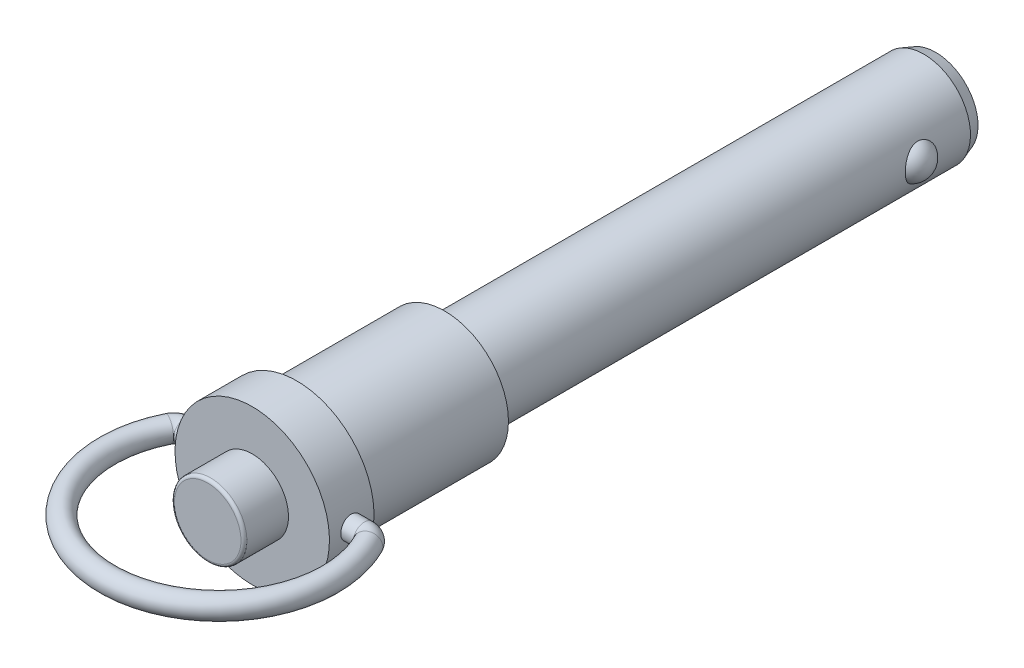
ISO-10303-21;
HEADER;
FILE_DESCRIPTION(('STEP AP214'),'2;1');
FILE_NAME('part.step','',(''),(''),'','','');
FILE_SCHEMA(('AUTOMOTIVE_DESIGN { 1 0 10303 214 1 1 1 1 }'));
ENDSEC;
DATA;
#1=APPLICATION_CONTEXT('core data for automotive mechanical design processes');
#2=APPLICATION_PROTOCOL_DEFINITION('international standard','automotive_design',2000,#1);
#3=PRODUCT_CONTEXT('',#1,'mechanical');
#4=PRODUCT('Part','Part','',(#3));
#5=PRODUCT_RELATED_PRODUCT_CATEGORY('part','',(#4));
#6=PRODUCT_DEFINITION_FORMATION('','',#4);
#7=PRODUCT_DEFINITION_CONTEXT('part definition',#1,'design');
#8=PRODUCT_DEFINITION('design','',#6,#7);
#9=PRODUCT_DEFINITION_SHAPE('','',#8);
#10=(LENGTH_UNIT() NAMED_UNIT(*) SI_UNIT(.MILLI.,.METRE.));
#11=(NAMED_UNIT(*) PLANE_ANGLE_UNIT() SI_UNIT($,.RADIAN.));
#12=(NAMED_UNIT(*) SI_UNIT($,.STERADIAN.) SOLID_ANGLE_UNIT());
#13=UNCERTAINTY_MEASURE_WITH_UNIT(LENGTH_MEASURE(1.E-05),#10,'distance_accuracy_value','');
#14=(GEOMETRIC_REPRESENTATION_CONTEXT(3) GLOBAL_UNCERTAINTY_ASSIGNED_CONTEXT((#13)) GLOBAL_UNIT_ASSIGNED_CONTEXT((#10,
#11,#12)) REPRESENTATION_CONTEXT('',''));
#15=CARTESIAN_POINT('',(0.,0.,0.));
#16=DIRECTION('',(0.,0.,1.));
#17=DIRECTION('',(1.,0.,0.));
#18=AXIS2_PLACEMENT_3D('',#15,#16,#17);
#19=CARTESIAN_POINT('',(0.,0.,40.545));
#20=DIRECTION('',(0.,0.,1.));
#21=DIRECTION('',(0.,1.,0.));
#22=AXIS2_PLACEMENT_3D('',#19,#20,#21);
#23=PLANE('',#22);
#24=CARTESIAN_POINT('',(0.,0.,40.545));
#25=DIRECTION('',(0.,0.,-1.));
#26=DIRECTION('',(0.,-1.,0.));
#27=AXIS2_PLACEMENT_3D('',#24,#25,#26);
#28=CIRCLE('',#27,5.6896);
#29=CARTESIAN_POINT('',(0.,-5.6896,40.545));
#30=VERTEX_POINT('',#29);
#31=CARTESIAN_POINT('',(0.,5.6896,40.545));
#32=VERTEX_POINT('',#31);
#33=EDGE_CURVE('E38',#30,#32,#28,.T.);
#34=ORIENTED_EDGE('',*,*,#33,.F.);
#35=CARTESIAN_POINT('',(0.,0.,40.545));
#36=DIRECTION('',(0.,0.,-1.));
#37=DIRECTION('',(0.,1.,0.));
#38=AXIS2_PLACEMENT_3D('',#35,#36,#37);
#39=CIRCLE('',#38,5.6896);
#40=EDGE_CURVE('E31',#32,#30,#39,.T.);
#41=ORIENTED_EDGE('',*,*,#40,.F.);
#42=EDGE_LOOP('',(#34,#41));
#43=FACE_BOUND('',#42,.T.);
#44=ADVANCED_FACE('F14',(#43),#23,.T.);
#45=CARTESIAN_POINT('',(0.,0.,40.037));
#46=DIRECTION('',(0.,0.,1.));
#47=DIRECTION('',(0.,1.,0.));
#48=AXIS2_PLACEMENT_3D('',#45,#46,#47);
#49=TOROIDAL_SURFACE('',#48,5.6896,0.508);
#50=ORIENTED_EDGE('',*,*,#40,.T.);
#51=ORIENTED_EDGE('',*,*,#33,.T.);
#52=EDGE_LOOP('',(#50,#51));
#53=FACE_BOUND('',#52,.T.);
#54=CARTESIAN_POINT('',(0.,0.,40.037));
#55=DIRECTION('',(0.,0.,-1.));
#56=DIRECTION('',(0.,-1.,0.));
#57=AXIS2_PLACEMENT_3D('',#54,#55,#56);
#58=CIRCLE('',#57,6.1976);
#59=CARTESIAN_POINT('',(0.,-6.1976,40.037));
#60=VERTEX_POINT('',#59);
#61=EDGE_CURVE('E80',#60,#60,#58,.T.);
#62=ORIENTED_EDGE('',*,*,#61,.F.);
#63=EDGE_LOOP('',(#62));
#64=FACE_BOUND('',#63,.T.);
#65=ADVANCED_FACE('F36',(#53,#64),#49,.T.);
#66=CARTESIAN_POINT('',(0.,0.,40.545));
#67=DIRECTION('',(0.,0.,-1.));
#68=DIRECTION('',(0.,-1.,0.));
#69=AXIS2_PLACEMENT_3D('',#66,#67,#68);
#70=CYLINDRICAL_SURFACE('',#69,6.1976);
#71=CARTESIAN_POINT('',(0.,0.,32.925));
#72=DIRECTION('',(0.,0.,-1.));
#73=DIRECTION('',(0.,-1.,0.));
#74=AXIS2_PLACEMENT_3D('',#71,#72,#73);
#75=CIRCLE('',#74,6.1976);
#76=CARTESIAN_POINT('',(0.,-6.1976,32.925));
#77=VERTEX_POINT('',#76);
#78=EDGE_CURVE('E231',#77,#77,#75,.T.);
#79=ORIENTED_EDGE('',*,*,#78,.F.);
#80=EDGE_LOOP('',(#79));
#81=FACE_BOUND('',#80,.T.);
#82=ORIENTED_EDGE('',*,*,#61,.T.);
#83=EDGE_LOOP('',(#82));
#84=FACE_BOUND('',#83,.T.);
#85=ADVANCED_FACE('F86',(#81,#84),#70,.T.);
#86=CARTESIAN_POINT('',(-13.208,0.,32.925));
#87=DIRECTION('',(0.,0.,1.));
#88=DIRECTION('',(0.,1.,0.));
#89=AXIS2_PLACEMENT_3D('',#86,#87,#88);
#90=PLANE('',#89);
#91=ORIENTED_EDGE('',*,*,#78,.T.);
#92=EDGE_LOOP('',(#91));
#93=FACE_BOUND('',#92,.T.);
#94=CARTESIAN_POINT('',(0.,0.,32.925));
#95=DIRECTION('',(0.,0.,-1.));
#96=DIRECTION('',(0.,-1.,0.));
#97=AXIS2_PLACEMENT_3D('',#94,#95,#96);
#98=CIRCLE('',#97,13.208);
#99=CARTESIAN_POINT('',(0.,-13.208,32.925));
#100=VERTEX_POINT('',#99);
#101=EDGE_CURVE('E234',#100,#100,#98,.T.);
#102=ORIENTED_EDGE('',*,*,#101,.F.);
#103=EDGE_LOOP('',(#102));
#104=FACE_BOUND('',#103,.T.);
#105=ADVANCED_FACE('F217',(#93,#104),#90,.T.);
#106=CARTESIAN_POINT('',(0.,0.,-2.));
#107=DIRECTION('',(0.,0.,-1.));
#108=DIRECTION('',(0.,-1.,0.));
#109=AXIS2_PLACEMENT_3D('',#106,#107,#108);
#110=CYLINDRICAL_SURFACE('',#109,13.208);
#111=CARTESIAN_POINT('',(0.,0.,25.305));
#112=DIRECTION('',(0.,0.,-1.));
#113=DIRECTION('',(0.,-1.,0.));
#114=AXIS2_PLACEMENT_3D('',#111,#112,#113);
#115=CIRCLE('',#114,13.208);
#116=CARTESIAN_POINT('',(0.,-13.208,25.305));
#117=VERTEX_POINT('',#116);
#118=EDGE_CURVE('E154',#117,#117,#115,.T.);
#119=ORIENTED_EDGE('',*,*,#118,.F.);
#120=EDGE_LOOP('',(#119));
#121=FACE_BOUND('',#120,.T.);
#122=ORIENTED_EDGE('',*,*,#101,.T.);
#123=EDGE_LOOP('',(#122));
#124=FACE_BOUND('',#123,.T.);
#125=CARTESIAN_POINT('',(13.208,0.,27.2354));
#126=CARTESIAN_POINT('',(13.2079983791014,-0.105008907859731,27.235404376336));
#127=CARTESIAN_POINT('',(13.2067345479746,-0.210080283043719,27.2442296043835));
#128=CARTESIAN_POINT('',(13.2018144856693,-0.417290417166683,27.2792908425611));
#129=CARTESIAN_POINT('',(13.1981558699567,-0.51942614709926,27.3055442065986));
#130=CARTESIAN_POINT('',(13.1888577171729,-0.717735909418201,27.3746649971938));
#131=CARTESIAN_POINT('',(13.1832196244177,-0.813914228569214,27.4175203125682));
#132=CARTESIAN_POINT('',(13.1705868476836,-0.997698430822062,27.5185998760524));
#133=CARTESIAN_POINT('',(13.1635923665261,-1.08530559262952,27.5768218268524));
#134=CARTESIAN_POINT('',(13.1489704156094,-1.25009506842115,27.7074204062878));
#135=CARTESIAN_POINT('',(13.1413392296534,-1.32720810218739,27.7798840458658));
#136=CARTESIAN_POINT('',(13.1263333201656,-1.46822296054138,27.9367218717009));
#137=CARTESIAN_POINT('',(13.1189586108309,-1.5321240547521,28.0210967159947));
#138=CARTESIAN_POINT('',(13.1052644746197,-1.6451672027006,28.1998226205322));
#139=CARTESIAN_POINT('',(13.0989498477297,-1.69424288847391,28.2942160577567));
#140=CARTESIAN_POINT('',(13.088141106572,-1.77581811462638,28.490010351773));
#141=CARTESIAN_POINT('',(13.0836469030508,-1.80831846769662,28.5914108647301));
#142=CARTESIAN_POINT('',(13.0770241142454,-1.85560673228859,28.7976151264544));
#143=CARTESIAN_POINT('',(13.0748797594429,-1.87051276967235,28.9023912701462));
#144=CARTESIAN_POINT('',(13.0731514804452,-1.88255508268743,29.1129780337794));
#145=CARTESIAN_POINT('',(13.0735674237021,-1.87969227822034,29.2187885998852));
#146=CARTESIAN_POINT('',(13.0768983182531,-1.85637484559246,29.4276098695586));
#147=CARTESIAN_POINT('',(13.07979464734,-1.8360513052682,29.5306355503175));
#148=CARTESIAN_POINT('',(13.0877308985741,-1.77859429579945,29.7317993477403));
#149=CARTESIAN_POINT('',(13.0927708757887,-1.74146039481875,29.8299373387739));
#150=CARTESIAN_POINT('',(13.1044472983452,-1.65129893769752,30.0189415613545));
#151=CARTESIAN_POINT('',(13.1110893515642,-1.59821538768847,30.1097807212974));
#152=CARTESIAN_POINT('',(13.1252173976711,-1.47770141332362,30.281311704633));
#153=CARTESIAN_POINT('',(13.1327034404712,-1.4102701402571,30.3620029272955));
#154=CARTESIAN_POINT('',(13.1477584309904,-1.26225301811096,30.5117076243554));
#155=CARTESIAN_POINT('',(13.1553275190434,-1.18155436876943,30.5806096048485));
#156=CARTESIAN_POINT('',(13.1696331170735,-1.00967896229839,30.7039085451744));
#157=CARTESIAN_POINT('',(13.1763696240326,-0.918502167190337,30.7583054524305));
#158=CARTESIAN_POINT('',(13.1882570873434,-0.728165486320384,30.8510539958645));
#159=CARTESIAN_POINT('',(13.1934072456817,-0.629001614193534,30.8893975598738));
#160=CARTESIAN_POINT('',(13.2015349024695,-0.425552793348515,30.9488568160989));
#161=CARTESIAN_POINT('',(13.2045125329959,-0.321268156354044,30.969973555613));
#162=CARTESIAN_POINT('',(13.2079422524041,-0.111500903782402,30.9942327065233));
#163=CARTESIAN_POINT('',(13.2084158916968,-0.0060363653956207,30.9975284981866));
#164=CARTESIAN_POINT('',(13.2068427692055,0.203940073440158,30.9864585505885));
#165=CARTESIAN_POINT('',(13.2047960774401,0.308452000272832,30.9720933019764));
#166=CARTESIAN_POINT('',(13.1984256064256,0.513095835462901,30.9262365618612));
#167=CARTESIAN_POINT('',(13.1941116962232,0.613244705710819,30.894819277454));
#168=CARTESIAN_POINT('',(13.1836891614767,0.806853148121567,30.8158281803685));
#169=CARTESIAN_POINT('',(13.1775804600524,0.900312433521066,30.7682536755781));
#170=CARTESIAN_POINT('',(13.1641942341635,1.07856665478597,30.6579350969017));
#171=CARTESIAN_POINT('',(13.1569092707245,1.16330041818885,30.5950930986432));
#172=CARTESIAN_POINT('',(13.1420059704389,1.32107337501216,30.4561604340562));
#173=CARTESIAN_POINT('',(13.1343876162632,1.39411195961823,30.3800690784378));
#174=CARTESIAN_POINT('',(13.1196084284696,1.52697484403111,30.2161171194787));
#175=CARTESIAN_POINT('',(13.1124514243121,1.58669669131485,30.1281730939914));
#176=CARTESIAN_POINT('',(13.099471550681,1.69052011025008,29.9434117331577));
#177=CARTESIAN_POINT('',(13.0936486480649,1.73462206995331,29.8465946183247));
#178=CARTESIAN_POINT('',(13.0840235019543,1.80579270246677,29.6471490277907));
#179=CARTESIAN_POINT('',(13.0802147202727,1.83291654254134,29.5445405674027));
#180=CARTESIAN_POINT('',(13.0750312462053,1.86953730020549,29.336166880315));
#181=CARTESIAN_POINT('',(13.0736564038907,1.87903530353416,29.2304018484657));
#182=CARTESIAN_POINT('',(13.0735016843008,1.88011086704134,29.0197377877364));
#183=CARTESIAN_POINT('',(13.0746984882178,1.87184946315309,28.9148395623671));
#184=CARTESIAN_POINT('',(13.0795017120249,1.83798448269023,28.7079399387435));
#185=CARTESIAN_POINT('',(13.0831081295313,1.81238092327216,28.6059385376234));
#186=CARTESIAN_POINT('',(13.092316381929,1.74461326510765,28.4077650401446));
#187=CARTESIAN_POINT('',(13.0979169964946,1.70245929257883,28.3115894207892));
#188=CARTESIAN_POINT('',(13.1104842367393,1.60280330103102,28.1276498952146));
#189=CARTESIAN_POINT('',(13.1174508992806,1.54530086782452,28.0398862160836));
#190=CARTESIAN_POINT('',(13.1320406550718,1.4159909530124,27.8744419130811));
#191=CARTESIAN_POINT('',(13.1396689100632,1.34406391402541,27.7968551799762));
#192=CARTESIAN_POINT('',(13.1546784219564,1.18819878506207,27.6547945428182));
#193=CARTESIAN_POINT('',(13.1620596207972,1.10425789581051,27.590323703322));
#194=CARTESIAN_POINT('',(13.1757845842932,0.926263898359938,27.4760444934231));
#195=CARTESIAN_POINT('',(13.1821230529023,0.832162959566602,27.4263100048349));
#196=CARTESIAN_POINT('',(13.1929960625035,0.636900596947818,27.3434245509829));
#197=CARTESIAN_POINT('',(13.1975325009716,0.535746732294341,27.3102561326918));
#198=CARTESIAN_POINT('',(13.2032356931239,0.361762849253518,27.2691055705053));
#199=CARTESIAN_POINT('',(13.205013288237,0.290014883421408,27.2564849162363));
#200=CARTESIAN_POINT('',(13.2073959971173,0.145521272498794,27.2396306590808));
#201=CARTESIAN_POINT('',(13.2080011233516,0.0727756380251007,27.2353969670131));
#202=CARTESIAN_POINT('',(13.208,0.,27.2354));
#203=B_SPLINE_CURVE_WITH_KNOTS('',3,(#125,#126,#127,#128,#129,#130,#131,#132,#133,#134,#135,
#136,#137,#138,#139,#140,#141,#142,#143,#144,#145,#146,#147,#148,#149,#150,#151,#152,#153,#154,
#155,#156,#157,#158,#159,#160,#161,#162,#163,#164,#165,#166,#167,#168,#169,#170,#171,#172,#173,
#174,#175,#176,#177,#178,#179,#180,#181,#182,#183,#184,#185,#186,#187,#188,#189,#190,#191,#192,
#193,#194,#195,#196,#197,#198,#199,#200,#201,#202),.UNSPECIFIED.,.T.,.F.,(4,2,2,2,2,2,2,2,2,2,2,
2,2,2,2,2,2,2,2,2,2,2,2,2,2,2,2,2,2,2,2,2,2,2,2,2,2,2,4),(0.,0.314760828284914,
0.629835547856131,0.944680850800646,1.25947911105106,1.57626405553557,1.89306650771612,
2.2112668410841,2.52945157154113,2.84548767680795,3.16150742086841,3.47517515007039,
3.7888509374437,4.1036410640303,4.41844981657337,4.73608844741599,5.05372822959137,
5.3715275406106,5.68930752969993,6.0043480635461,6.31937984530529,6.63305153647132,
6.94673666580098,7.2624894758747,7.57825871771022,7.89637938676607,8.21449215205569,
8.53156582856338,8.84861997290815,9.16281131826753,9.4770023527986,9.79100145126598,
10.1050090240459,10.42173562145,10.7385361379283,11.0568990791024,11.3749259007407,
11.5930708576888,11.8112134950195),.UNSPECIFIED.);
#204=CARTESIAN_POINT('',(13.208,0.,27.2354));
#205=VERTEX_POINT('',#204);
#206=EDGE_CURVE('E147',#205,#205,#203,.T.);
#207=ORIENTED_EDGE('',*,*,#206,.T.);
#208=EDGE_LOOP('',(#207));
#209=FACE_BOUND('',#208,.T.);
#210=CARTESIAN_POINT('',(-13.208,0.,27.2354));
#211=CARTESIAN_POINT('',(-13.2079983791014,0.105008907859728,27.235404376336));
#212=CARTESIAN_POINT('',(-13.2067345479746,0.210080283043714,27.2442296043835));
#213=CARTESIAN_POINT('',(-13.2018144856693,0.41729041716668,27.2792908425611));
#214=CARTESIAN_POINT('',(-13.1981558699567,0.519426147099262,27.3055442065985));
#215=CARTESIAN_POINT('',(-13.1888577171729,0.7177359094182,27.3746649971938));
#216=CARTESIAN_POINT('',(-13.1832196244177,0.813914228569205,27.4175203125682));
#217=CARTESIAN_POINT('',(-13.1705868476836,0.99769843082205,27.5185998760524));
#218=CARTESIAN_POINT('',(-13.1635923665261,1.08530559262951,27.5768218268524));
#219=CARTESIAN_POINT('',(-13.1489704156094,1.25009506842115,27.7074204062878));
#220=CARTESIAN_POINT('',(-13.1413392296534,1.32720810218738,27.7798840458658));
#221=CARTESIAN_POINT('',(-13.1263333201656,1.46822296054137,27.9367218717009));
#222=CARTESIAN_POINT('',(-13.1189586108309,1.5321240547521,28.0210967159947));
#223=CARTESIAN_POINT('',(-13.1052644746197,1.6451672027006,28.1998226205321));
#224=CARTESIAN_POINT('',(-13.0989498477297,1.69424288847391,28.2942160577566));
#225=CARTESIAN_POINT('',(-13.088141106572,1.77581811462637,28.490010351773));
#226=CARTESIAN_POINT('',(-13.0836469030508,1.80831846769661,28.5914108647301));
#227=CARTESIAN_POINT('',(-13.0770241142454,1.85560673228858,28.7976151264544));
#228=CARTESIAN_POINT('',(-13.0748797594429,1.87051276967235,28.9023912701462));
#229=CARTESIAN_POINT('',(-13.0731514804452,1.88255508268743,29.1129780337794));
#230=CARTESIAN_POINT('',(-13.0735674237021,1.87969227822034,29.2187885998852));
#231=CARTESIAN_POINT('',(-13.0768983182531,1.85637484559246,29.4276098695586));
#232=CARTESIAN_POINT('',(-13.07979464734,1.8360513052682,29.5306355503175));
#233=CARTESIAN_POINT('',(-13.0877308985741,1.77859429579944,29.7317993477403));
#234=CARTESIAN_POINT('',(-13.0927708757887,1.74146039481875,29.8299373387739));
#235=CARTESIAN_POINT('',(-13.1044472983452,1.65129893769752,30.0189415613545));
#236=CARTESIAN_POINT('',(-13.1110893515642,1.59821538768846,30.1097807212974));
#237=CARTESIAN_POINT('',(-13.1252173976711,1.47770141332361,30.281311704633));
#238=CARTESIAN_POINT('',(-13.1327034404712,1.4102701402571,30.3620029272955));
#239=CARTESIAN_POINT('',(-13.1477584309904,1.26225301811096,30.5117076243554));
#240=CARTESIAN_POINT('',(-13.1553275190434,1.18155436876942,30.5806096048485));
#241=CARTESIAN_POINT('',(-13.1696331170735,1.00967896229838,30.7039085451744));
#242=CARTESIAN_POINT('',(-13.1763696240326,0.918502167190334,30.7583054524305));
#243=CARTESIAN_POINT('',(-13.1882570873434,0.728165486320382,30.8510539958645));
#244=CARTESIAN_POINT('',(-13.1934072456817,0.62900161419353,30.8893975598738));
#245=CARTESIAN_POINT('',(-13.2015349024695,0.425552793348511,30.9488568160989));
#246=CARTESIAN_POINT('',(-13.2045125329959,0.321268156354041,30.969973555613));
#247=CARTESIAN_POINT('',(-13.2079422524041,0.111500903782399,30.9942327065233));
#248=CARTESIAN_POINT('',(-13.2084158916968,0.00603636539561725,30.9975284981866));
#249=CARTESIAN_POINT('',(-13.2068427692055,-0.203940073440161,30.9864585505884));
#250=CARTESIAN_POINT('',(-13.2047960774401,-0.308452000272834,30.9720933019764));
#251=CARTESIAN_POINT('',(-13.1984256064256,-0.513095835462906,30.9262365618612));
#252=CARTESIAN_POINT('',(-13.1941116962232,-0.613244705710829,30.894819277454));
#253=CARTESIAN_POINT('',(-13.1836891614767,-0.806853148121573,30.8158281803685));
#254=CARTESIAN_POINT('',(-13.1775804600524,-0.900312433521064,30.768253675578));
#255=CARTESIAN_POINT('',(-13.1641942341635,-1.07856665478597,30.6579350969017));
#256=CARTESIAN_POINT('',(-13.1569092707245,-1.16330041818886,30.5950930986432));
#257=CARTESIAN_POINT('',(-13.1420059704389,-1.32107337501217,30.4561604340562));
#258=CARTESIAN_POINT('',(-13.1343876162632,-1.39411195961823,30.3800690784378));
#259=CARTESIAN_POINT('',(-13.1196084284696,-1.52697484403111,30.2161171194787));
#260=CARTESIAN_POINT('',(-13.1124514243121,-1.58669669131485,30.1281730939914));
#261=CARTESIAN_POINT('',(-13.099471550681,-1.69052011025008,29.9434117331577));
#262=CARTESIAN_POINT('',(-13.0936486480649,-1.73462206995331,29.8465946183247));
#263=CARTESIAN_POINT('',(-13.0840235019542,-1.80579270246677,29.6471490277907));
#264=CARTESIAN_POINT('',(-13.0802147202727,-1.83291654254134,29.5445405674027));
#265=CARTESIAN_POINT('',(-13.0750312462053,-1.86953730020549,29.336166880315));
#266=CARTESIAN_POINT('',(-13.0736564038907,-1.87903530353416,29.2304018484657));
#267=CARTESIAN_POINT('',(-13.0735016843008,-1.88011086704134,29.0197377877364));
#268=CARTESIAN_POINT('',(-13.0746984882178,-1.87184946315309,28.9148395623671));
#269=CARTESIAN_POINT('',(-13.0795017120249,-1.83798448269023,28.7079399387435));
#270=CARTESIAN_POINT('',(-13.0831081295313,-1.81238092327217,28.6059385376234));
#271=CARTESIAN_POINT('',(-13.092316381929,-1.74461326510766,28.4077650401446));
#272=CARTESIAN_POINT('',(-13.0979169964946,-1.70245929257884,28.3115894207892));
#273=CARTESIAN_POINT('',(-13.1104842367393,-1.60280330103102,28.1276498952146));
#274=CARTESIAN_POINT('',(-13.1174508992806,-1.54530086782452,28.0398862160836));
#275=CARTESIAN_POINT('',(-13.1320406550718,-1.41599095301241,27.8744419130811));
#276=CARTESIAN_POINT('',(-13.1396689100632,-1.34406391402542,27.7968551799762));
#277=CARTESIAN_POINT('',(-13.1546784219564,-1.18819878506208,27.6547945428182));
#278=CARTESIAN_POINT('',(-13.1620596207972,-1.10425789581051,27.590323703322));
#279=CARTESIAN_POINT('',(-13.1757845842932,-0.926263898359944,27.4760444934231));
#280=CARTESIAN_POINT('',(-13.1821230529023,-0.832162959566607,27.4263100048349));
#281=CARTESIAN_POINT('',(-13.1929960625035,-0.636900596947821,27.3434245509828));
#282=CARTESIAN_POINT('',(-13.1975325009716,-0.535746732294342,27.3102561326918));
#283=CARTESIAN_POINT('',(-13.2032356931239,-0.361762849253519,27.2691055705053));
#284=CARTESIAN_POINT('',(-13.205013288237,-0.29001488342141,27.2564849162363));
#285=CARTESIAN_POINT('',(-13.2073959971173,-0.145521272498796,27.2396306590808));
#286=CARTESIAN_POINT('',(-13.2080011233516,-0.0727756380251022,27.2353969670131));
#287=CARTESIAN_POINT('',(-13.208,0.,27.2354));
#288=B_SPLINE_CURVE_WITH_KNOTS('',3,(#210,#211,#212,#213,#214,#215,#216,#217,#218,#219,#220,
#221,#222,#223,#224,#225,#226,#227,#228,#229,#230,#231,#232,#233,#234,#235,#236,#237,#238,#239,
#240,#241,#242,#243,#244,#245,#246,#247,#248,#249,#250,#251,#252,#253,#254,#255,#256,#257,#258,
#259,#260,#261,#262,#263,#264,#265,#266,#267,#268,#269,#270,#271,#272,#273,#274,#275,#276,#277,
#278,#279,#280,#281,#282,#283,#284,#285,#286,#287),.UNSPECIFIED.,.T.,.F.,(4,2,2,2,2,2,2,2,2,2,2,
2,2,2,2,2,2,2,2,2,2,2,2,2,2,2,2,2,2,2,2,2,2,2,2,2,2,2,4),(0.,0.314760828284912,
0.629835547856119,0.944680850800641,1.25947911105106,1.57626405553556,1.89306650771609,
2.21126684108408,2.52945157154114,2.84548767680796,3.16150742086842,3.4751751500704,
3.78885093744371,4.10364106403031,4.41844981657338,4.736088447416,5.05372822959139,
5.37152754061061,5.68930752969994,6.00434806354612,6.3193798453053,6.63305153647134,
6.94673666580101,7.26248947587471,7.57825871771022,7.89637938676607,8.21449215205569,
8.53156582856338,8.84861997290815,9.16281131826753,9.4770023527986,9.79100145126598,
10.1050090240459,10.42173562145,10.7385361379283,11.0568990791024,11.3749259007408,
11.5930708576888,11.8112134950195),.UNSPECIFIED.);
#289=CARTESIAN_POINT('',(-13.208,0.,27.2354));
#290=VERTEX_POINT('',#289);
#291=EDGE_CURVE('E24',#290,#290,#288,.T.);
#292=ORIENTED_EDGE('',*,*,#291,.T.);
#293=EDGE_LOOP('',(#292));
#294=FACE_BOUND('',#293,.T.);
#295=ADVANCED_FACE('F210',(#121,#124,#209,#294),#110,.T.);
#296=CARTESIAN_POINT('',(-12.319,0.,25.305));
#297=DIRECTION('',(0.,0.,-1.));
#298=DIRECTION('',(0.,-1.,0.));
#299=AXIS2_PLACEMENT_3D('',#296,#297,#298);
#300=PLANE('',#299);
#301=ORIENTED_EDGE('',*,*,#118,.T.);
#302=EDGE_LOOP('',(#301));
#303=FACE_BOUND('',#302,.T.);
#304=CARTESIAN_POINT('',(0.,0.,25.305));
#305=DIRECTION('',(0.,0.,1.));
#306=DIRECTION('',(1.,0.,0.));
#307=AXIS2_PLACEMENT_3D('',#304,#305,#306);
#308=CIRCLE('',#307,11.3);
#309=CARTESIAN_POINT('',(11.3,0.,25.305));
#310=VERTEX_POINT('',#309);
#311=EDGE_CURVE('E141',#310,#310,#308,.T.);
#312=ORIENTED_EDGE('',*,*,#311,.T.);
#313=EDGE_LOOP('',(#312));
#314=FACE_BOUND('',#313,.T.);
#315=ADVANCED_FACE('F208',(#303,#314),#300,.T.);
#316=CARTESIAN_POINT('',(-15.3586010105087,0.,31.02));
#317=DIRECTION('',(0.,1.,0.));
#318=DIRECTION('',(-1.,0.,0.));
#319=AXIS2_PLACEMENT_3D('',#316,#317,#318);
#320=TOROIDAL_SURFACE('',#319,1.905,1.8796);
#321=CARTESIAN_POINT('',(-15.3586010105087,0.,29.115));
#322=DIRECTION('',(1.,0.,0.));
#323=DIRECTION('',(0.,0.,-1.));
#324=AXIS2_PLACEMENT_3D('',#321,#322,#323);
#325=CIRCLE('',#324,1.8796);
#326=CARTESIAN_POINT('',(-15.3586010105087,0.,27.2354));
#327=VERTEX_POINT('',#326);
#328=EDGE_CURVE('E40',#327,#327,#325,.T.);
#329=ORIENTED_EDGE('',*,*,#328,.F.);
#330=EDGE_LOOP('',(#329));
#331=FACE_BOUND('',#330,.T.);
#332=CARTESIAN_POINT('',(-17.0651122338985,0.,30.1733333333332));
#333=DIRECTION('',(-0.44444444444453,0.,0.895806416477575));
#334=DIRECTION('',(-0.895806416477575,0.,-0.44444444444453));
#335=AXIS2_PLACEMENT_3D('',#332,#333,#334);
#336=CIRCLE('',#335,1.8796);
#337=CARTESIAN_POINT('',(-18.7488699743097,0.,29.3379555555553));
#338=VERTEX_POINT('',#337);
#339=EDGE_CURVE('E146',#338,#338,#336,.F.);
#340=ORIENTED_EDGE('',*,*,#339,.T.);
#341=EDGE_LOOP('',(#340));
#342=FACE_BOUND('',#341,.T.);
#343=ADVANCED_FACE('F63',(#331,#342),#320,.T.);
#344=CARTESIAN_POINT('',(-15.3586010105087,0.,29.115));
#345=DIRECTION('',(1.,0.,0.));
#346=DIRECTION('',(0.,0.,-1.));
#347=AXIS2_PLACEMENT_3D('',#344,#345,#346);
#348=CYLINDRICAL_SURFACE('',#347,1.8796);
#349=ORIENTED_EDGE('',*,*,#291,.F.);
#350=EDGE_LOOP('',(#349));
#351=FACE_BOUND('',#350,.T.);
#352=ORIENTED_EDGE('',*,*,#328,.T.);
#353=EDGE_LOOP('',(#352));
#354=FACE_BOUND('',#353,.T.);
#355=ADVANCED_FACE('F87',(#351,#354),#348,.T.);
#356=CARTESIAN_POINT('',(0.,0.,38.64));
#357=DIRECTION('',(0.,1.,0.));
#358=DIRECTION('',(-1.,0.,0.));
#359=AXIS2_PLACEMENT_3D('',#356,#357,#358);
#360=TOROIDAL_SURFACE('',#359,19.05,1.8796);
#361=ORIENTED_EDGE('',*,*,#339,.F.);
#362=EDGE_LOOP('',(#361));
#363=FACE_BOUND('',#362,.T.);
#364=CARTESIAN_POINT('',(17.0651122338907,0.,30.1733333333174));
#365=DIRECTION('',(-0.444444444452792,0.,-0.895806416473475));
#366=DIRECTION('',(0.895806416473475,0.,-0.444444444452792));
#367=AXIS2_PLACEMENT_3D('',#364,#365,#366);
#368=CIRCLE('',#367,1.8796);
#369=CARTESIAN_POINT('',(18.7488699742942,0.,29.3379555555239));
#370=VERTEX_POINT('',#369);
#371=EDGE_CURVE('E241',#370,#370,#368,.T.);
#372=ORIENTED_EDGE('',*,*,#371,.F.);
#373=EDGE_LOOP('',(#372));
#374=FACE_BOUND('',#373,.T.);
#375=ADVANCED_FACE('F168',(#363,#374),#360,.T.);
#376=CARTESIAN_POINT('',(15.3586010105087,0.,31.02));
#377=DIRECTION('',(0.,1.,0.));
#378=DIRECTION('',(-1.,0.,0.));
#379=AXIS2_PLACEMENT_3D('',#376,#377,#378);
#380=TOROIDAL_SURFACE('',#379,1.90500000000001,1.8796);
#381=CARTESIAN_POINT('',(15.3586010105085,0.,29.115));
#382=DIRECTION('',(1.,0.,0.));
#383=DIRECTION('',(0.,0.,-1.));
#384=AXIS2_PLACEMENT_3D('',#381,#382,#383);
#385=CIRCLE('',#384,1.8796);
#386=CARTESIAN_POINT('',(15.3586010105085,0.,27.2354));
#387=VERTEX_POINT('',#386);
#388=EDGE_CURVE('E44',#387,#387,#385,.F.);
#389=ORIENTED_EDGE('',*,*,#388,.F.);
#390=EDGE_LOOP('',(#389));
#391=FACE_BOUND('',#390,.T.);
#392=ORIENTED_EDGE('',*,*,#371,.T.);
#393=EDGE_LOOP('',(#392));
#394=FACE_BOUND('',#393,.T.);
#395=ADVANCED_FACE('F65',(#391,#394),#380,.T.);
#396=CARTESIAN_POINT('',(-15.3586010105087,0.,29.115));
#397=DIRECTION('',(1.,0.,0.));
#398=DIRECTION('',(0.,0.,-1.));
#399=AXIS2_PLACEMENT_3D('',#396,#397,#398);
#400=CYLINDRICAL_SURFACE('',#399,1.8796);
#401=ORIENTED_EDGE('',*,*,#206,.F.);
#402=EDGE_LOOP('',(#401));
#403=FACE_BOUND('',#402,.T.);
#404=ORIENTED_EDGE('',*,*,#388,.T.);
#405=EDGE_LOOP('',(#404));
#406=FACE_BOUND('',#405,.T.);
#407=ADVANCED_FACE('F89',(#403,#406),#400,.T.);
#408=CARTESIAN_POINT('',(0.,0.,24.905));
#409=DIRECTION('',(0.,0.,1.));
#410=DIRECTION('',(1.,0.,0.));
#411=AXIS2_PLACEMENT_3D('',#408,#409,#410);
#412=TOROIDAL_SURFACE('',#411,11.3,0.4);
#413=CARTESIAN_POINT('',(0.,0.,24.905));
#414=DIRECTION('',(0.,0.,1.));
#415=DIRECTION('',(1.,0.,0.));
#416=AXIS2_PLACEMENT_3D('',#413,#414,#415);
#417=CIRCLE('',#416,10.9);
#418=CARTESIAN_POINT('',(10.9,0.,24.905));
#419=VERTEX_POINT('',#418);
#420=EDGE_CURVE('E132',#419,#419,#417,.T.);
#421=ORIENTED_EDGE('',*,*,#420,.T.);
#422=EDGE_LOOP('',(#421));
#423=FACE_BOUND('',#422,.T.);
#424=ORIENTED_EDGE('',*,*,#311,.F.);
#425=EDGE_LOOP('',(#424));
#426=FACE_BOUND('',#425,.T.);
#427=ADVANCED_FACE('F161',(#423,#426),#412,.F.);
#428=CARTESIAN_POINT('',(0.,0.,44.4499215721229));
#429=DIRECTION('',(0.,0.,1.));
#430=DIRECTION('',(1.,0.,0.));
#431=AXIS2_PLACEMENT_3D('',#428,#429,#430);
#432=CYLINDRICAL_SURFACE('',#431,10.9);
#433=CARTESIAN_POINT('',(0.,0.,0.));
#434=DIRECTION('',(0.,0.,1.));
#435=DIRECTION('',(1.,0.,0.));
#436=AXIS2_PLACEMENT_3D('',#433,#434,#435);
#437=CIRCLE('',#436,10.9);
#438=CARTESIAN_POINT('',(10.9,0.,0.));
#439=VERTEX_POINT('',#438);
#440=EDGE_CURVE('E136',#439,#439,#437,.T.);
#441=ORIENTED_EDGE('',*,*,#440,.T.);
#442=EDGE_LOOP('',(#441));
#443=FACE_BOUND('',#442,.T.);
#444=ORIENTED_EDGE('',*,*,#420,.F.);
#445=EDGE_LOOP('',(#444));
#446=FACE_BOUND('',#445,.T.);
#447=ADVANCED_FACE('F166',(#443,#446),#432,.T.);
#448=CARTESIAN_POINT('',(0.,0.,0.));
#449=DIRECTION('',(0.,0.,-1.));
#450=DIRECTION('',(0.,1.,0.));
#451=AXIS2_PLACEMENT_3D('',#448,#449,#450);
#452=PLANE('',#451);
#453=CARTESIAN_POINT('',(0.,0.,0.));
#454=DIRECTION('',(0.,0.,-1.));
#455=DIRECTION('',(0.,1.,0.));
#456=AXIS2_PLACEMENT_3D('',#453,#454,#455);
#457=CIRCLE('',#456,7.972425);
#458=CARTESIAN_POINT('',(0.,7.97242499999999,0.));
#459=VERTEX_POINT('',#458);
#460=EDGE_CURVE('E9',#459,#459,#457,.T.);
#461=ORIENTED_EDGE('',*,*,#460,.F.);
#462=EDGE_LOOP('',(#461));
#463=FACE_BOUND('',#462,.T.);
#464=ORIENTED_EDGE('',*,*,#440,.F.);
#465=EDGE_LOOP('',(#464));
#466=FACE_BOUND('',#465,.T.);
#467=ADVANCED_FACE('F163',(#463,#466),#452,.T.);
#468=CARTESIAN_POINT('',(-7.23283748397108,0.,-83.9826));
#469=DIRECTION('',(0.,0.,1.));
#470=DIRECTION('',(0.,1.,0.));
#471=AXIS2_PLACEMENT_3D('',#468,#469,#470);
#472=PLANE('',#471);
#473=CARTESIAN_POINT('',(0.,0.,-83.9826));
#474=DIRECTION('',(0.,0.,1.));
#475=DIRECTION('',(0.,1.,0.));
#476=AXIS2_PLACEMENT_3D('',#473,#474,#475);
#477=CIRCLE('',#476,7.23283748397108);
#478=CARTESIAN_POINT('',(0.,7.23283748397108,-83.9826));
#479=VERTEX_POINT('',#478);
#480=EDGE_CURVE('E19',#479,#479,#477,.T.);
#481=ORIENTED_EDGE('',*,*,#480,.F.);
#482=EDGE_LOOP('',(#481));
#483=FACE_BOUND('',#482,.T.);
#484=ADVANCED_FACE('F62',(#483),#472,.F.);
#485=CARTESIAN_POINT('',(6.3254,0.,-73.5178));
#486=DIRECTION('',(0.,0.,1.));
#487=DIRECTION('',(-1.,0.,0.));
#488=AXIS2_PLACEMENT_3D('',#485,#486,#487);
#489=SPHERICAL_SURFACE('',#488,3.175);
#490=CARTESIAN_POINT('',(7.972425,0.,-70.8034062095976));
#491=CARTESIAN_POINT('',(7.97241726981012,0.174963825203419,-70.8034110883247));
#492=CARTESIAN_POINT('',(7.96661031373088,0.350072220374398,-70.8168531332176));
#493=CARTESIAN_POINT('',(7.94391651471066,0.695574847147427,-70.8705412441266));
#494=CARTESIAN_POINT('',(7.92701418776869,0.865962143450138,-70.9108247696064));
#495=CARTESIAN_POINT('',(7.88381094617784,1.19705751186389,-71.0178494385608));
#496=CARTESIAN_POINT('',(7.85750751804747,1.35776298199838,-71.084597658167));
#497=CARTESIAN_POINT('',(7.79828591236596,1.66454963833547,-71.2437588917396));
#498=CARTESIAN_POINT('',(7.76536929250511,1.81063425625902,-71.336165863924));
#499=CARTESIAN_POINT('',(7.6973220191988,2.0808213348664,-71.5434318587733));
#500=CARTESIAN_POINT('',(7.6622476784,2.20529978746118,-71.6578132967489));
#501=CARTESIAN_POINT('',(7.61082801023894,2.374525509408,-71.8452714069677));
#502=CARTESIAN_POINT('',(7.59387880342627,2.42804053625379,-71.9104406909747));
#503=CARTESIAN_POINT('',(7.56094914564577,2.52871559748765,-72.045725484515));
#504=CARTESIAN_POINT('',(7.54496815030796,2.57587922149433,-72.115838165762));
#505=CARTESIAN_POINT('',(7.51569590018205,2.66002101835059,-72.2550958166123));
#506=CARTESIAN_POINT('',(7.50229271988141,2.69749875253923,-72.3239160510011));
#507=CARTESIAN_POINT('',(7.47725403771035,2.76614659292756,-72.4649044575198));
#508=CARTESIAN_POINT('',(7.46561758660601,2.79732008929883,-72.5370708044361));
#509=CARTESIAN_POINT('',(7.44451748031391,2.85299970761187,-72.6841997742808));
#510=CARTESIAN_POINT('',(7.43505273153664,2.87750918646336,-72.7591609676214));
#511=CARTESIAN_POINT('',(7.41863811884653,2.91956849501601,-72.9112788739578));
#512=CARTESIAN_POINT('',(7.41168797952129,2.93711908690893,-72.9884353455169));
#513=CARTESIAN_POINT('',(7.40116212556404,2.96353478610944,-73.13590466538));
#514=CARTESIAN_POINT('',(7.39730521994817,2.97312751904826,-73.206067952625));
#515=CARTESIAN_POINT('',(7.39192783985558,2.98647205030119,-73.3470623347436));
#516=CARTESIAN_POINT('',(7.3904081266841,2.99022194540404,-73.417893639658));
#517=CARTESIAN_POINT('',(7.38975833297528,2.99182794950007,-73.5595897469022));
#518=CARTESIAN_POINT('',(7.39062662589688,2.98968807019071,-73.6304544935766));
#519=CARTESIAN_POINT('',(7.39471686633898,2.97955470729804,-73.7717034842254));
#520=CARTESIAN_POINT('',(7.39793967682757,2.97155907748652,-73.8420875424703));
#521=CARTESIAN_POINT('',(7.41052697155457,2.94009947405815,-74.0439191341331));
#522=CARTESIAN_POINT('',(7.42280379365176,2.90920494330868,-74.1741115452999));
#523=CARTESIAN_POINT('',(7.45413145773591,2.82795803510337,-74.4273054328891));
#524=CARTESIAN_POINT('',(7.47318306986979,2.77760344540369,-74.5503060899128));
#525=CARTESIAN_POINT('',(7.51696016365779,2.65690222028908,-74.7909708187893));
#526=CARTESIAN_POINT('',(7.5418730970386,2.58587106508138,-74.9082567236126));
#527=CARTESIAN_POINT('',(7.59450635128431,2.426938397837,-75.1300314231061));
#528=CARTESIAN_POINT('',(7.62222751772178,2.33903179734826,-75.234516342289));
#529=CARTESIAN_POINT('',(7.68069620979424,2.13967899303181,-75.4383986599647));
#530=CARTESIAN_POINT('',(7.71148158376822,2.02679150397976,-75.5363756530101));
#531=CARTESIAN_POINT('',(7.77061509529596,1.78672707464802,-75.7138815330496));
#532=CARTESIAN_POINT('',(7.79896157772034,1.65954056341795,-75.7933979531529));
#533=CARTESIAN_POINT('',(7.85313577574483,1.38188004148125,-75.939506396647));
#534=CARTESIAN_POINT('',(7.87849512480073,1.23034006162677,-76.0042480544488));
#535=CARTESIAN_POINT('',(7.92093083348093,0.918236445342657,-76.1099613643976));
#536=CARTESIAN_POINT('',(7.9380155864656,0.757682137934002,-76.1509571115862));
#537=CARTESIAN_POINT('',(7.95754077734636,0.496793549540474,-76.1973352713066));
#538=CARTESIAN_POINT('',(7.96310427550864,0.397984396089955,-76.2104005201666));
#539=CARTESIAN_POINT('',(7.97054862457,0.199465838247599,-76.2278312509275));
#540=CARTESIAN_POINT('',(7.97242940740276,0.0997564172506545,-76.2321965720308));
#541=CARTESIAN_POINT('',(7.97241726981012,-0.174963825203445,-76.2321889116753));
#542=CARTESIAN_POINT('',(7.96661031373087,-0.350072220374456,-76.2187468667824));
#543=CARTESIAN_POINT('',(7.94391651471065,-0.695574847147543,-76.1650587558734));
#544=CARTESIAN_POINT('',(7.92701418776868,-0.865962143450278,-76.1247752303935));
#545=CARTESIAN_POINT('',(7.88381094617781,-1.19705751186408,-76.0177505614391));
#546=CARTESIAN_POINT('',(7.85750751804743,-1.3577629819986,-75.9510023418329));
#547=CARTESIAN_POINT('',(7.79828591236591,-1.66454963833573,-75.7918411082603));
#548=CARTESIAN_POINT('',(7.76536929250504,-1.8106342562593,-75.6994341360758));
#549=CARTESIAN_POINT('',(7.69732201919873,-2.08082133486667,-75.4921681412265));
#550=CARTESIAN_POINT('',(7.66224767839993,-2.20529978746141,-75.3777867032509));
#551=CARTESIAN_POINT('',(7.61082801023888,-2.37452550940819,-75.190328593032));
#552=CARTESIAN_POINT('',(7.59387880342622,-2.42804053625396,-75.125159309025));
#553=CARTESIAN_POINT('',(7.5609491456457,-2.52871559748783,-74.9898745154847));
#554=CARTESIAN_POINT('',(7.54496815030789,-2.57587922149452,-74.9197618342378));
#555=CARTESIAN_POINT('',(7.51569590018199,-2.66002101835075,-74.7805041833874));
#556=CARTESIAN_POINT('',(7.50229271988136,-2.69749875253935,-74.7116839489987));
#557=CARTESIAN_POINT('',(7.47725403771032,-2.76614659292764,-74.57069554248));
#558=CARTESIAN_POINT('',(7.46561758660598,-2.79732008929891,-74.4985291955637));
#559=CARTESIAN_POINT('',(7.44451748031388,-2.85299970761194,-74.351400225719));
#560=CARTESIAN_POINT('',(7.43505273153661,-2.87750918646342,-74.2764390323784));
#561=CARTESIAN_POINT('',(7.41863811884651,-2.91956849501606,-74.124321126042));
#562=CARTESIAN_POINT('',(7.41168797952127,-2.93711908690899,-74.0471646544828));
#563=CARTESIAN_POINT('',(7.40116212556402,-2.96353478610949,-73.8996953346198));
#564=CARTESIAN_POINT('',(7.39730521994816,-2.97312751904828,-73.8295320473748));
#565=CARTESIAN_POINT('',(7.39192783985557,-2.98647205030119,-73.6885376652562));
#566=CARTESIAN_POINT('',(7.3904081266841,-2.99022194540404,-73.6177063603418));
#567=CARTESIAN_POINT('',(7.38975833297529,-2.99182794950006,-73.4760102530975));
#568=CARTESIAN_POINT('',(7.39062662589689,-2.98968807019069,-73.4051455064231));
#569=CARTESIAN_POINT('',(7.39471686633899,-2.979554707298,-73.2638965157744));
#570=CARTESIAN_POINT('',(7.39793967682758,-2.97155907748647,-73.1935124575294));
#571=CARTESIAN_POINT('',(7.41052697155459,-2.94009947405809,-72.9916808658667));
#572=CARTESIAN_POINT('',(7.42280379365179,-2.90920494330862,-72.8614884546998));
#573=CARTESIAN_POINT('',(7.45413145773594,-2.82795803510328,-72.6082945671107));
#574=CARTESIAN_POINT('',(7.47318306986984,-2.77760344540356,-72.485293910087));
#575=CARTESIAN_POINT('',(7.51696016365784,-2.65690222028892,-72.2446291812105));
#576=CARTESIAN_POINT('',(7.54187309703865,-2.58587106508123,-72.1273432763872));
#577=CARTESIAN_POINT('',(7.59450635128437,-2.42693839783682,-71.9055685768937));
#578=CARTESIAN_POINT('',(7.62222751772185,-2.33903179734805,-71.8010836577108));
#579=CARTESIAN_POINT('',(7.68069620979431,-2.13967899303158,-71.5972013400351));
#580=CARTESIAN_POINT('',(7.71148158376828,-2.02679150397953,-71.4992243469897));
#581=CARTESIAN_POINT('',(7.77061509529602,-1.78672707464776,-71.3217184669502));
#582=CARTESIAN_POINT('',(7.7989615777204,-1.65954056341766,-71.242202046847));
#583=CARTESIAN_POINT('',(7.85313577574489,-1.38188004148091,-71.0960936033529));
#584=CARTESIAN_POINT('',(7.87849512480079,-1.23034006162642,-71.0313519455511));
#585=CARTESIAN_POINT('',(7.92093083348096,-0.918236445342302,-70.9256386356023));
#586=CARTESIAN_POINT('',(7.93801558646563,-0.757682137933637,-70.8846428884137));
#587=CARTESIAN_POINT('',(7.95754077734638,-0.496793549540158,-70.8382647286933));
#588=CARTESIAN_POINT('',(7.96310427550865,-0.3979843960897,-70.8251994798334));
#589=CARTESIAN_POINT('',(7.97054862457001,-0.199465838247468,-70.8077687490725));
#590=CARTESIAN_POINT('',(7.97242940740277,-0.0997564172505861,-70.8034034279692));
#591=CARTESIAN_POINT('',(7.972425,0.,-70.8034062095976));
#592=B_SPLINE_CURVE_WITH_KNOTS('',3,(#490,#491,#492,#493,#494,#495,#496,#497,#498,#499,#500,
#501,#502,#503,#504,#505,#506,#507,#508,#509,#510,#511,#512,#513,#514,#515,#516,#517,#518,#519,
#520,#521,#522,#523,#524,#525,#526,#527,#528,#529,#530,#531,#532,#533,#534,#535,#536,#537,#538,
#539,#540,#541,#542,#543,#544,#545,#546,#547,#548,#549,#550,#551,#552,#553,#554,#555,#556,#557,
#558,#559,#560,#561,#562,#563,#564,#565,#566,#567,#568,#569,#570,#571,#572,#573,#574,#575,#576,
#577,#578,#579,#580,#581,#582,#583,#584,#585,#586,#587,#588,#589,#590,#591),.UNSPECIFIED.,.T.,
.F.,(4,2,2,2,2,2,2,2,2,2,2,2,2,2,2,2,2,2,2,2,2,2,2,2,2,2,2,2,2,2,2,2,2,2,2,2,2,2,2,2,2,2,2,2,2,
2,2,2,2,2,4),(0.,0.524532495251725,1.04979855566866,1.57520515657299,2.10048814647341,
2.61543479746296,2.87315909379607,3.130737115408,3.36891793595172,3.60697032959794,
3.84490258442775,4.08280877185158,4.29529683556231,4.50785409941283,4.72026662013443,
4.93275703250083,5.33386765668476,5.73502389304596,6.15136290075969,6.56782764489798,
7.02375816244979,7.47999569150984,7.97801301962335,8.47552411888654,8.77458316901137,
9.07364774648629,9.59818024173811,10.1234463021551,10.6488529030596,11.17413589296,
11.6890825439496,11.9468068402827,12.2043848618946,12.4425656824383,12.6806180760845,
12.9185503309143,13.1564565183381,13.3689445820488,13.5815018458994,13.793914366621,
14.0064047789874,14.4075154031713,14.8086716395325,15.2250106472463,15.6414753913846,
16.0974059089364,16.5536434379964,17.05166076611,17.5491718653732,17.8482309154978,
18.1472954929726),.UNSPECIFIED.);
#593=CARTESIAN_POINT('',(7.972425,0.,-70.8034062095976));
#594=VERTEX_POINT('',#593);
#595=EDGE_CURVE('E119',#594,#594,#592,.T.);
#596=ORIENTED_EDGE('',*,*,#595,.F.);
#597=EDGE_LOOP('',(#596));
#598=FACE_BOUND('',#597,.T.);
#599=ADVANCED_FACE('F110',(#598),#489,.T.);
#600=CARTESIAN_POINT('',(-6.3246,0.,-73.5178));
#601=DIRECTION('',(0.,0.,1.));
#602=DIRECTION('',(-1.,0.,0.));
#603=AXIS2_PLACEMENT_3D('',#600,#601,#602);
#604=SPHERICAL_SURFACE('',#603,3.175);
#605=CARTESIAN_POINT('',(-7.972425,0.,-76.2317082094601));
#606=CARTESIAN_POINT('',(-7.97241727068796,0.174952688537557,-76.2317033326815));
#607=CARTESIAN_POINT('',(-7.96661105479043,0.350049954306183,-76.2182623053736));
#608=CARTESIAN_POINT('',(-7.94392013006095,0.695530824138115,-76.1645780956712));
#609=CARTESIAN_POINT('',(-7.92701993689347,0.86590749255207,-76.1242974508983));
#610=CARTESIAN_POINT('',(-7.88382210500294,1.19698257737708,-76.0172798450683));
#611=CARTESIAN_POINT('',(-7.85752194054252,1.35767837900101,-75.950535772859));
#612=CARTESIAN_POINT('',(-7.79830777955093,1.66444625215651,-75.7913834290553));
#613=CARTESIAN_POINT('',(-7.76539534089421,1.81052175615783,-75.6989812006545));
#614=CARTESIAN_POINT('',(-7.69735815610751,2.08068673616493,-75.4917274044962));
#615=CARTESIAN_POINT('',(-7.66228978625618,2.20515274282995,-75.3773541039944));
#616=CARTESIAN_POINT('',(-7.61087967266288,2.37435974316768,-75.1899087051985));
#617=CARTESIAN_POINT('',(-7.59393375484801,2.42786851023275,-75.124743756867));
#618=CARTESIAN_POINT('',(-7.56101087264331,2.52853087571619,-74.9894677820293));
#619=CARTESIAN_POINT('',(-7.54503336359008,2.57568806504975,-74.9193595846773));
#620=CARTESIAN_POINT('',(-7.515769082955,2.65981407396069,-74.7801158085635));
#621=CARTESIAN_POINT('',(-7.5023702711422,2.69728292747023,-74.7113052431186));
#622=CARTESIAN_POINT('',(-7.47734019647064,2.76591355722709,-74.5703368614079));
#623=CARTESIAN_POINT('',(-7.46570798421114,2.79707872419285,-74.4981808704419));
#624=CARTESIAN_POINT('',(-7.44461613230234,2.8527421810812,-74.3510733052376));
#625=CARTESIAN_POINT('',(-7.43515539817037,2.87724383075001,-74.2761231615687));
#626=CARTESIAN_POINT('',(-7.41874848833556,2.91928796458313,-74.1240280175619));
#627=CARTESIAN_POINT('',(-7.41180203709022,2.93683121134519,-74.0468832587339));
#628=CARTESIAN_POINT('',(-7.40128307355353,2.96323267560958,-73.8994411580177));
#629=CARTESIAN_POINT('',(-7.39742927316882,2.97281883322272,-73.829293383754));
#630=CARTESIAN_POINT('',(-7.3920573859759,2.98615137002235,-73.6883306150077));
#631=CARTESIAN_POINT('',(-7.39054006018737,2.98989584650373,-73.6175154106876));
#632=CARTESIAN_POINT('',(-7.38989424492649,2.99149222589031,-73.4758519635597));
#633=CARTESIAN_POINT('',(-7.39076412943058,2.98934813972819,-73.4050037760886));
#634=CARTESIAN_POINT('',(-7.39485671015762,2.97920762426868,-73.2637882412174));
#635=CARTESIAN_POINT('',(-7.39808026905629,2.971209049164,-73.1934210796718));
#636=CARTESIAN_POINT('',(-7.41066840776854,2.93974298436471,-72.9916394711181));
#637=CARTESIAN_POINT('',(-7.42294415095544,2.90884676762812,-72.8614803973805));
#638=CARTESIAN_POINT('',(-7.45426659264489,2.82760178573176,-72.6083526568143));
#639=CARTESIAN_POINT('',(-7.4733140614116,2.77725080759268,-72.4853848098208));
#640=CARTESIAN_POINT('',(-7.51708080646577,2.6565607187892,-72.2447817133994));
#641=CARTESIAN_POINT('',(-7.5419875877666,2.5855367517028,-72.1275248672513));
#642=CARTESIAN_POINT('',(-7.59460690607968,2.42662332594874,-71.9058059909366));
#643=CARTESIAN_POINT('',(-7.62232028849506,2.33872877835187,-71.80134783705));
#644=CARTESIAN_POINT('',(-7.68077324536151,2.13940178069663,-71.5975136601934));
#645=CARTESIAN_POINT('',(-7.71155061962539,2.02652778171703,-71.4995584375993));
#646=CARTESIAN_POINT('',(-7.77066832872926,1.78649437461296,-71.3220926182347));
#647=CARTESIAN_POINT('',(-7.79900700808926,1.65932539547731,-71.2425944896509));
#648=CARTESIAN_POINT('',(-7.85316757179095,1.38169777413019,-71.0965158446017));
#649=CARTESIAN_POINT('',(-7.87852090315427,1.23017281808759,-71.0317864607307));
#650=CARTESIAN_POINT('',(-7.92094613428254,0.918101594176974,-70.9260941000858));
#651=CARTESIAN_POINT('',(-7.93802642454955,0.757564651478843,-70.8851070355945));
#652=CARTESIAN_POINT('',(-7.95754577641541,0.496710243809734,-70.8387404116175));
#653=CARTESIAN_POINT('',(-7.96310740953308,0.397917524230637,-70.8256788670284));
#654=CARTESIAN_POINT('',(-7.97054925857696,0.199432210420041,-70.8082530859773));
#655=CARTESIAN_POINT('',(-7.97242940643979,0.0997395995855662,-70.8038890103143));
#656=CARTESIAN_POINT('',(-7.97241727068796,-0.17495268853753,-70.8038966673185));
#657=CARTESIAN_POINT('',(-7.96661105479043,-0.350049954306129,-70.8173376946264));
#658=CARTESIAN_POINT('',(-7.94392013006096,-0.695530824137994,-70.8710219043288));
#659=CARTESIAN_POINT('',(-7.92701993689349,-0.865907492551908,-70.9113025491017));
#660=CARTESIAN_POINT('',(-7.88382210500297,-1.19698257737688,-71.0183201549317));
#661=CARTESIAN_POINT('',(-7.85752194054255,-1.35767837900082,-71.0850642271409));
#662=CARTESIAN_POINT('',(-7.79830777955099,-1.66444625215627,-71.2442165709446));
#663=CARTESIAN_POINT('',(-7.76539534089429,-1.81052175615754,-71.3366187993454));
#664=CARTESIAN_POINT('',(-7.69735815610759,-2.08068673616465,-71.5438725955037));
#665=CARTESIAN_POINT('',(-7.66228978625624,-2.20515274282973,-71.6582458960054));
#666=CARTESIAN_POINT('',(-7.61087967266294,-2.37435974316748,-71.8456912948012));
#667=CARTESIAN_POINT('',(-7.59393375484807,-2.42786851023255,-71.9108562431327));
#668=CARTESIAN_POINT('',(-7.56101087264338,-2.52853087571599,-72.0461322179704));
#669=CARTESIAN_POINT('',(-7.54503336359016,-2.57568806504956,-72.1162404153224));
#670=CARTESIAN_POINT('',(-7.51576908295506,-2.65981407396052,-72.2554841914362));
#671=CARTESIAN_POINT('',(-7.50237027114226,-2.69728292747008,-72.3242947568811));
#672=CARTESIAN_POINT('',(-7.47734019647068,-2.76591355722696,-72.4652631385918));
#673=CARTESIAN_POINT('',(-7.46570798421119,-2.79707872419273,-72.5374191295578));
#674=CARTESIAN_POINT('',(-7.44461613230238,-2.85274218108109,-72.6845266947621));
#675=CARTESIAN_POINT('',(-7.4351553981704,-2.87724383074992,-72.759476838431));
#676=CARTESIAN_POINT('',(-7.41874848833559,-2.91928796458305,-72.9115719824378));
#677=CARTESIAN_POINT('',(-7.41180203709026,-2.93683121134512,-72.9887167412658));
#678=CARTESIAN_POINT('',(-7.40128307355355,-2.96323267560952,-73.136158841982));
#679=CARTESIAN_POINT('',(-7.39742927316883,-2.97281883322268,-73.2063066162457));
#680=CARTESIAN_POINT('',(-7.3920573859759,-2.98615137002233,-73.347269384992));
#681=CARTESIAN_POINT('',(-7.39054006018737,-2.98989584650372,-73.4180845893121));
#682=CARTESIAN_POINT('',(-7.38989424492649,-2.99149222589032,-73.55974803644));
#683=CARTESIAN_POINT('',(-7.39076412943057,-2.9893481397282,-73.6305962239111));
#684=CARTESIAN_POINT('',(-7.39485671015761,-2.97920762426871,-73.7718117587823));
#685=CARTESIAN_POINT('',(-7.39808026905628,-2.97120904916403,-73.8421789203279));
#686=CARTESIAN_POINT('',(-7.41066840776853,-2.93974298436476,-74.0439605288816));
#687=CARTESIAN_POINT('',(-7.42294415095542,-2.90884676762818,-74.1741196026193));
#688=CARTESIAN_POINT('',(-7.45426659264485,-2.82760178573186,-74.4272473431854));
#689=CARTESIAN_POINT('',(-7.47331406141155,-2.77725080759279,-74.550215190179));
#690=CARTESIAN_POINT('',(-7.51708080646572,-2.65656071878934,-74.7908182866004));
#691=CARTESIAN_POINT('',(-7.54198758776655,-2.58553675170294,-74.9080751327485));
#692=CARTESIAN_POINT('',(-7.59460690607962,-2.4266233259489,-75.1297940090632));
#693=CARTESIAN_POINT('',(-7.62232028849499,-2.33872877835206,-75.2342521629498));
#694=CARTESIAN_POINT('',(-7.68077324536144,-2.13940178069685,-75.4380863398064));
#695=CARTESIAN_POINT('',(-7.71155061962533,-2.02652778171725,-75.5360415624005));
#696=CARTESIAN_POINT('',(-7.77066832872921,-1.7864943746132,-75.7135073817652));
#697=CARTESIAN_POINT('',(-7.7990070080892,-1.65932539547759,-75.793005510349));
#698=CARTESIAN_POINT('',(-7.85316757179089,-1.3816977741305,-75.9390841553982));
#699=CARTESIAN_POINT('',(-7.87852090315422,-1.23017281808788,-76.0038135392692));
#700=CARTESIAN_POINT('',(-7.9209461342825,-0.918101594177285,-76.1095058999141));
#701=CARTESIAN_POINT('',(-7.93802642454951,-0.757564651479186,-76.1504929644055));
#702=CARTESIAN_POINT('',(-7.95754577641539,-0.496710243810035,-76.1968595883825));
#703=CARTESIAN_POINT('',(-7.96310740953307,-0.397917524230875,-76.2099211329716));
#704=CARTESIAN_POINT('',(-7.97054925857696,-0.199432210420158,-76.2273469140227));
#705=CARTESIAN_POINT('',(-7.97242940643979,-0.0997395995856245,-76.2317109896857));
#706=CARTESIAN_POINT('',(-7.972425,0.,-76.2317082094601));
#707=B_SPLINE_CURVE_WITH_KNOTS('',3,(#605,#606,#607,#608,#609,#610,#611,#612,#613,#614,#615,
#616,#617,#618,#619,#620,#621,#622,#623,#624,#625,#626,#627,#628,#629,#630,#631,#632,#633,#634,
#635,#636,#637,#638,#639,#640,#641,#642,#643,#644,#645,#646,#647,#648,#649,#650,#651,#652,#653,
#654,#655,#656,#657,#658,#659,#660,#661,#662,#663,#664,#665,#666,#667,#668,#669,#670,#671,#672,
#673,#674,#675,#676,#677,#678,#679,#680,#681,#682,#683,#684,#685,#686,#687,#688,#689,#690,#691,
#692,#693,#694,#695,#696,#697,#698,#699,#700,#701,#702,#703,#704,#705,#706),.UNSPECIFIED.,.T.,
.F.,(4,2,2,2,2,2,2,2,2,2,2,2,2,2,2,2,2,2,2,2,2,2,2,2,2,2,2,2,2,2,2,2,2,2,2,2,2,2,2,2,2,2,2,2,2,
2,2,2,2,2,4),(0.,0.524499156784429,1.04973194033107,1.57510595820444,2.10035634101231,
2.61525617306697,2.87295695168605,3.13051142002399,3.36865238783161,3.6066649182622,
3.84455721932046,4.08242344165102,4.29486234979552,4.50737043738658,4.7197338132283,
4.93217506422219,5.33319020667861,5.73425097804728,6.15050279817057,6.56688037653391,
7.02273464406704,7.47889596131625,7.97685568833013,8.47430932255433,8.773317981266,
9.07233216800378,9.59683132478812,10.1220641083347,10.647438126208,11.1726885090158,
11.6875883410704,11.9452891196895,12.2028435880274,12.4409845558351,12.6789970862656,
12.9168893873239,13.1547556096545,13.367194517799,13.57970260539,13.7920659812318,
14.0045072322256,14.4055223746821,14.8065831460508,15.2228349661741,15.6392125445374,
16.0950668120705,16.5512281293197,17.0491878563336,17.5466414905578,17.8456501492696,
18.1446643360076),.UNSPECIFIED.);
#708=CARTESIAN_POINT('',(-7.972425,0.,-76.2317082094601));
#709=VERTEX_POINT('',#708);
#710=EDGE_CURVE('E125',#709,#709,#707,.T.);
#711=ORIENTED_EDGE('',*,*,#710,.F.);
#712=EDGE_LOOP('',(#711));
#713=FACE_BOUND('',#712,.T.);
#714=ADVANCED_FACE('F115',(#713),#604,.T.);
#715=CARTESIAN_POINT('',(0.,0.,-81.9506));
#716=DIRECTION('',(0.,0.,1.));
#717=DIRECTION('',(0.,1.,0.));
#718=AXIS2_PLACEMENT_3D('',#715,#716,#717);
#719=CONICAL_SURFACE('',#718,7.972425,0.349065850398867);
#720=CARTESIAN_POINT('',(0.,0.,-81.9506));
#721=DIRECTION('',(0.,0.,1.));
#722=DIRECTION('',(0.,1.,0.));
#723=AXIS2_PLACEMENT_3D('',#720,#721,#722);
#724=CIRCLE('',#723,7.972425);
#725=CARTESIAN_POINT('',(0.,7.972425,-81.9506));
#726=VERTEX_POINT('',#725);
#727=EDGE_CURVE('E130',#726,#726,#724,.T.);
#728=ORIENTED_EDGE('',*,*,#727,.F.);
#729=EDGE_LOOP('',(#728));
#730=FACE_BOUND('',#729,.T.);
#731=ORIENTED_EDGE('',*,*,#480,.T.);
#732=EDGE_LOOP('',(#731));
#733=FACE_BOUND('',#732,.T.);
#734=ADVANCED_FACE('F182',(#730,#733),#719,.T.);
#735=CARTESIAN_POINT('',(0.,0.,-20.));
#736=DIRECTION('',(0.,0.,1.));
#737=DIRECTION('',(0.,1.,0.));
#738=AXIS2_PLACEMENT_3D('',#735,#736,#737);
#739=CYLINDRICAL_SURFACE('',#738,7.972425);
#740=ORIENTED_EDGE('',*,*,#727,.T.);
#741=EDGE_LOOP('',(#740));
#742=FACE_BOUND('',#741,.T.);
#743=ORIENTED_EDGE('',*,*,#710,.T.);
#744=EDGE_LOOP('',(#743));
#745=FACE_BOUND('',#744,.T.);
#746=ORIENTED_EDGE('',*,*,#595,.T.);
#747=EDGE_LOOP('',(#746));
#748=FACE_BOUND('',#747,.T.);
#749=ORIENTED_EDGE('',*,*,#460,.T.);
#750=EDGE_LOOP('',(#749));
#751=FACE_BOUND('',#750,.T.);
#752=ADVANCED_FACE('F16',(#742,#745,#748,#751),#739,.T.);
#753=CLOSED_SHELL('',(#44,#65,#85,#105,#295,#315,#343,#355,#375,#395,#407,#427,#447,#467,#484,
#599,#714,#734,#752));
#754=MANIFOLD_SOLID_BREP('B1',#753);
#755=ADVANCED_BREP_SHAPE_REPRESENTATION('',(#18,#754),#14);
#756=SHAPE_DEFINITION_REPRESENTATION(#9,#755);
ENDSEC;
END-ISO-10303-21;
